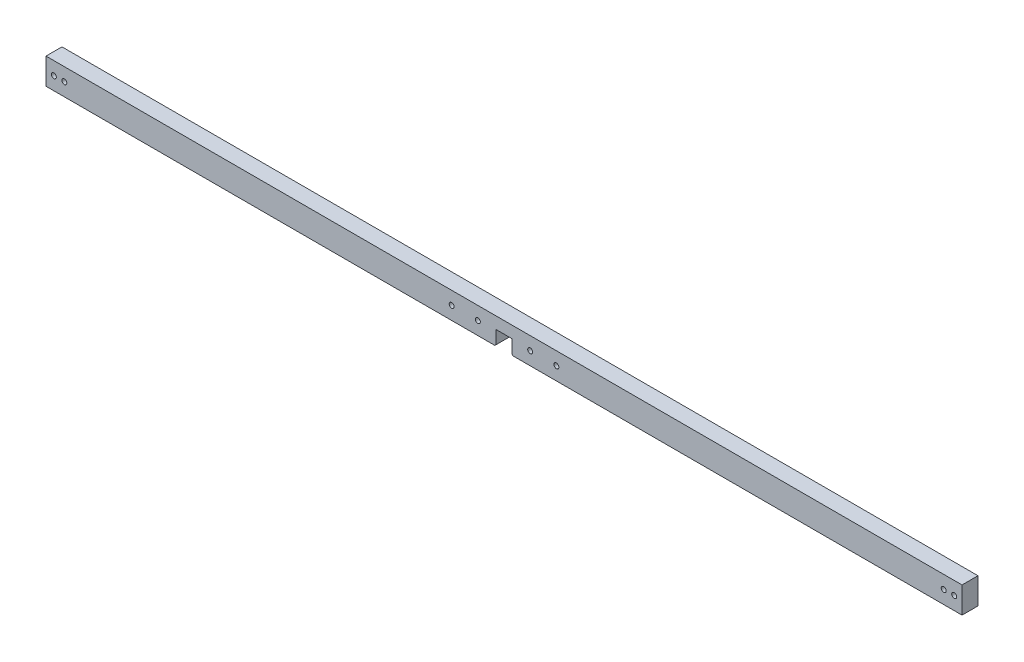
ISO-10303-21;
HEADER;
FILE_DESCRIPTION(('STEP AP214'),'2;1');
FILE_NAME('part.step','',(''),(''),'','','');
FILE_SCHEMA(('AUTOMOTIVE_DESIGN { 1 0 10303 214 1 1 1 1 }'));
ENDSEC;
DATA;
#1=APPLICATION_CONTEXT('core data for automotive mechanical design processes');
#2=APPLICATION_PROTOCOL_DEFINITION('international standard','automotive_design',2000,#1);
#3=PRODUCT_CONTEXT('',#1,'mechanical');
#4=PRODUCT('Part','Part','',(#3));
#5=PRODUCT_RELATED_PRODUCT_CATEGORY('part','',(#4));
#6=PRODUCT_DEFINITION_FORMATION('','',#4);
#7=PRODUCT_DEFINITION_CONTEXT('part definition',#1,'design');
#8=PRODUCT_DEFINITION('design','',#6,#7);
#9=PRODUCT_DEFINITION_SHAPE('','',#8);
#10=(LENGTH_UNIT() NAMED_UNIT(*) SI_UNIT(.MILLI.,.METRE.));
#11=(NAMED_UNIT(*) PLANE_ANGLE_UNIT() SI_UNIT($,.RADIAN.));
#12=(NAMED_UNIT(*) SI_UNIT($,.STERADIAN.) SOLID_ANGLE_UNIT());
#13=UNCERTAINTY_MEASURE_WITH_UNIT(LENGTH_MEASURE(1.E-05),#10,'distance_accuracy_value','');
#14=(GEOMETRIC_REPRESENTATION_CONTEXT(3) GLOBAL_UNCERTAINTY_ASSIGNED_CONTEXT((#13)) GLOBAL_UNIT_ASSIGNED_CONTEXT((#10,
#11,#12)) REPRESENTATION_CONTEXT('',''));
#15=CARTESIAN_POINT('',(0.,0.,0.));
#16=DIRECTION('',(0.,0.,1.));
#17=DIRECTION('',(1.,0.,0.));
#18=AXIS2_PLACEMENT_3D('',#15,#16,#17);
#19=CARTESIAN_POINT('',(175.,-4.99999999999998,3.05));
#20=DIRECTION('',(0.,1.,0.));
#21=DIRECTION('',(-1.,0.,0.));
#22=AXIS2_PLACEMENT_3D('',#19,#20,#21);
#23=PLANE('',#22);
#24=DIRECTION('',(1.,0.,0.));
#25=VECTOR('',#24,1.);
#26=CARTESIAN_POINT('',(175.,-4.99999999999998,3.05));
#27=LINE('',#26,#25);
#28=CARTESIAN_POINT('',(3.49999999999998,-5.,3.05));
#29=VERTEX_POINT('',#28);
#30=CARTESIAN_POINT('',(175.,-4.99999999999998,3.05));
#31=VERTEX_POINT('',#30);
#32=EDGE_CURVE('E188',#29,#31,#27,.T.);
#33=ORIENTED_EDGE('',*,*,#32,.F.);
#34=DIRECTION('',(0.,0.,-1.));
#35=VECTOR('',#34,1.);
#36=CARTESIAN_POINT('',(3.49999999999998,-5.,3.05));
#37=LINE('',#36,#35);
#38=CARTESIAN_POINT('',(3.49999999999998,-5.,-3.05));
#39=VERTEX_POINT('',#38);
#40=EDGE_CURVE('E223',#29,#39,#37,.T.);
#41=ORIENTED_EDGE('',*,*,#40,.T.);
#42=DIRECTION('',(1.,0.,0.));
#43=VECTOR('',#42,1.);
#44=CARTESIAN_POINT('',(175.,-4.99999999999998,-3.05));
#45=LINE('',#44,#43);
#46=CARTESIAN_POINT('',(175.,-4.99999999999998,-3.05));
#47=VERTEX_POINT('',#46);
#48=EDGE_CURVE('E199',#39,#47,#45,.T.);
#49=ORIENTED_EDGE('',*,*,#48,.T.);
#50=DIRECTION('',(0.,0.,-1.));
#51=VECTOR('',#50,1.);
#52=CARTESIAN_POINT('',(175.,-4.99999999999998,3.05));
#53=LINE('',#52,#51);
#54=EDGE_CURVE('E211',#31,#47,#53,.T.);
#55=ORIENTED_EDGE('',*,*,#54,.F.);
#56=EDGE_LOOP('',(#33,#41,#49,#55));
#57=FACE_BOUND('',#56,.T.);
#58=ADVANCED_FACE('F33',(#57),#23,.F.);
#59=CARTESIAN_POINT('',(-175.,-5.00000000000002,3.05));
#60=DIRECTION('',(1.,0.,0.));
#61=DIRECTION('',(0.,0.,-1.));
#62=AXIS2_PLACEMENT_3D('',#59,#60,#61);
#63=PLANE('',#62);
#64=DIRECTION('',(0.,-1.,0.));
#65=VECTOR('',#64,1.);
#66=CARTESIAN_POINT('',(-175.,-5.00000000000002,-3.05));
#67=LINE('',#66,#65);
#68=CARTESIAN_POINT('',(-175.,4.99999999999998,-3.05));
#69=VERTEX_POINT('',#68);
#70=CARTESIAN_POINT('',(-175.,-5.00000000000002,-3.05));
#71=VERTEX_POINT('',#70);
#72=EDGE_CURVE('E164',#69,#71,#67,.T.);
#73=ORIENTED_EDGE('',*,*,#72,.T.);
#74=DIRECTION('',(0.,0.,-1.));
#75=VECTOR('',#74,1.);
#76=CARTESIAN_POINT('',(-175.,-5.00000000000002,3.05));
#77=LINE('',#76,#75);
#78=CARTESIAN_POINT('',(-175.,-5.00000000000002,3.05));
#79=VERTEX_POINT('',#78);
#80=EDGE_CURVE('E214',#79,#71,#77,.T.);
#81=ORIENTED_EDGE('',*,*,#80,.F.);
#82=DIRECTION('',(0.,-1.,0.));
#83=VECTOR('',#82,1.);
#84=CARTESIAN_POINT('',(-175.,-5.00000000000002,3.05));
#85=LINE('',#84,#83);
#86=CARTESIAN_POINT('',(-175.,4.99999999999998,3.05));
#87=VERTEX_POINT('',#86);
#88=EDGE_CURVE('E185',#87,#79,#85,.T.);
#89=ORIENTED_EDGE('',*,*,#88,.F.);
#90=DIRECTION('',(0.,0.,-1.));
#91=VECTOR('',#90,1.);
#92=CARTESIAN_POINT('',(-175.,4.99999999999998,3.05));
#93=LINE('',#92,#91);
#94=EDGE_CURVE('E196',#87,#69,#93,.T.);
#95=ORIENTED_EDGE('',*,*,#94,.T.);
#96=EDGE_LOOP('',(#73,#81,#89,#95));
#97=FACE_BOUND('',#96,.T.);
#98=ADVANCED_FACE('F241',(#97),#63,.F.);
#99=CARTESIAN_POINT('',(-3.50000000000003,-5.,-3.05));
#100=VERTEX_POINT('',#99);
#101=EDGE_CURVE('E200',#71,#100,#45,.T.);
#102=ORIENTED_EDGE('',*,*,#101,.T.);
#103=DIRECTION('',(0.,0.,1.));
#104=VECTOR('',#103,1.);
#105=CARTESIAN_POINT('',(-3.50000000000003,-5.,3.05));
#106=LINE('',#105,#104);
#107=CARTESIAN_POINT('',(-3.50000000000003,-5.,3.05));
#108=VERTEX_POINT('',#107);
#109=EDGE_CURVE('E41',#100,#108,#106,.T.);
#110=ORIENTED_EDGE('',*,*,#109,.T.);
#111=EDGE_CURVE('E190',#79,#108,#27,.T.);
#112=ORIENTED_EDGE('',*,*,#111,.F.);
#113=ORIENTED_EDGE('',*,*,#80,.T.);
#114=EDGE_LOOP('',(#102,#110,#112,#113));
#115=FACE_BOUND('',#114,.T.);
#116=ADVANCED_FACE('F234',(#115),#23,.F.);
#117=CARTESIAN_POINT('',(175.,-4.99999999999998,3.05));
#118=DIRECTION('',(-1.,0.,0.));
#119=DIRECTION('',(0.,0.,1.));
#120=AXIS2_PLACEMENT_3D('',#117,#118,#119);
#121=PLANE('',#120);
#122=DIRECTION('',(0.,1.,0.));
#123=VECTOR('',#122,1.);
#124=CARTESIAN_POINT('',(175.,-4.99999999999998,-3.05));
#125=LINE('',#124,#123);
#126=CARTESIAN_POINT('',(175.,5.00000000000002,-3.05));
#127=VERTEX_POINT('',#126);
#128=EDGE_CURVE('E203',#47,#127,#125,.T.);
#129=ORIENTED_EDGE('',*,*,#128,.T.);
#130=DIRECTION('',(0.,0.,-1.));
#131=VECTOR('',#130,1.);
#132=CARTESIAN_POINT('',(175.,5.00000000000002,3.05));
#133=LINE('',#132,#131);
#134=CARTESIAN_POINT('',(175.,5.00000000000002,3.05));
#135=VERTEX_POINT('',#134);
#136=EDGE_CURVE('E208',#135,#127,#133,.T.);
#137=ORIENTED_EDGE('',*,*,#136,.F.);
#138=DIRECTION('',(0.,1.,0.));
#139=VECTOR('',#138,1.);
#140=CARTESIAN_POINT('',(175.,-4.99999999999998,3.05));
#141=LINE('',#140,#139);
#142=EDGE_CURVE('E192',#31,#135,#141,.T.);
#143=ORIENTED_EDGE('',*,*,#142,.F.);
#144=ORIENTED_EDGE('',*,*,#54,.T.);
#145=EDGE_LOOP('',(#129,#137,#143,#144));
#146=FACE_BOUND('',#145,.T.);
#147=ADVANCED_FACE('F261',(#146),#121,.F.);
#148=CARTESIAN_POINT('',(175.,5.00000000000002,3.05));
#149=DIRECTION('',(0.,-1.,0.));
#150=DIRECTION('',(1.,0.,0.));
#151=AXIS2_PLACEMENT_3D('',#148,#149,#150);
#152=PLANE('',#151);
#153=DIRECTION('',(-1.,0.,0.));
#154=VECTOR('',#153,1.);
#155=CARTESIAN_POINT('',(175.,5.00000000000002,-3.05));
#156=LINE('',#155,#154);
#157=EDGE_CURVE('E189',#127,#69,#156,.T.);
#158=ORIENTED_EDGE('',*,*,#157,.T.);
#159=ORIENTED_EDGE('',*,*,#94,.F.);
#160=DIRECTION('',(-1.,0.,0.));
#161=VECTOR('',#160,1.);
#162=CARTESIAN_POINT('',(175.,5.00000000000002,3.05));
#163=LINE('',#162,#161);
#164=EDGE_CURVE('E194',#135,#87,#163,.T.);
#165=ORIENTED_EDGE('',*,*,#164,.F.);
#166=ORIENTED_EDGE('',*,*,#136,.T.);
#167=EDGE_LOOP('',(#158,#159,#165,#166));
#168=FACE_BOUND('',#167,.T.);
#169=ADVANCED_FACE('F263',(#168),#152,.F.);
#170=CARTESIAN_POINT('',(0.,0.,3.05));
#171=DIRECTION('',(0.,0.,1.));
#172=DIRECTION('',(1.,0.,0.));
#173=AXIS2_PLACEMENT_3D('',#170,#171,#172);
#174=PLANE('',#173);
#175=DIRECTION('',(0.,1.,0.));
#176=VECTOR('',#175,1.);
#177=CARTESIAN_POINT('',(3.,-12.5622462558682,3.05));
#178=LINE('',#177,#176);
#179=CARTESIAN_POINT('',(3.,-4.50000000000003,3.05));
#180=VERTEX_POINT('',#179);
#181=CARTESIAN_POINT('',(3.,0.5,3.05));
#182=VERTEX_POINT('',#181);
#183=EDGE_CURVE('E110',#180,#182,#178,.T.);
#184=ORIENTED_EDGE('',*,*,#183,.F.);
#185=DIRECTION('',(-0.707106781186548,0.707106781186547,0.));
#186=VECTOR('',#185,1.);
#187=CARTESIAN_POINT('',(-0.750000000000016,-0.750000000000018,3.05));
#188=LINE('',#187,#186);
#189=EDGE_CURVE('E232',#180,#29,#188,.F.);
#190=ORIENTED_EDGE('',*,*,#189,.T.);
#191=ORIENTED_EDGE('',*,*,#32,.T.);
#192=ORIENTED_EDGE('',*,*,#142,.T.);
#193=ORIENTED_EDGE('',*,*,#164,.T.);
#194=ORIENTED_EDGE('',*,*,#88,.T.);
#195=ORIENTED_EDGE('',*,*,#111,.T.);
#196=DIRECTION('',(-0.70710678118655,-0.707106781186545,0.));
#197=VECTOR('',#196,1.);
#198=CARTESIAN_POINT('',(0.749999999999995,-0.75,3.05));
#199=LINE('',#198,#197);
#200=CARTESIAN_POINT('',(-3.,-4.49999999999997,3.05));
#201=VERTEX_POINT('',#200);
#202=EDGE_CURVE('E48',#108,#201,#199,.F.);
#203=ORIENTED_EDGE('',*,*,#202,.T.);
#204=DIRECTION('',(0.,-1.,0.));
#205=VECTOR('',#204,1.);
#206=CARTESIAN_POINT('',(-3.,-12.5622462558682,3.05));
#207=LINE('',#206,#205);
#208=CARTESIAN_POINT('',(-3.,0.5,3.05));
#209=VERTEX_POINT('',#208);
#210=EDGE_CURVE('E128',#209,#201,#207,.T.);
#211=ORIENTED_EDGE('',*,*,#210,.F.);
#212=DIRECTION('',(-1.,0.,0.));
#213=VECTOR('',#212,1.);
#214=CARTESIAN_POINT('',(-3.,0.5,3.05));
#215=LINE('',#214,#213);
#216=EDGE_CURVE('E119',#182,#209,#215,.T.);
#217=ORIENTED_EDGE('',*,*,#216,.F.);
#218=EDGE_LOOP('',(#184,#190,#191,#192,#193,#194,#195,#203,#211,#217));
#219=FACE_BOUND('',#218,.T.);
#220=CARTESIAN_POINT('',(-10.,0.,3.05));
#221=DIRECTION('',(0.,0.,-1.));
#222=DIRECTION('',(-1.,0.,0.));
#223=AXIS2_PLACEMENT_3D('',#220,#221,#222);
#224=CIRCLE('',#223,0.949999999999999);
#225=CARTESIAN_POINT('',(-10.95,0.,3.05));
#226=VERTEX_POINT('',#225);
#227=EDGE_CURVE('E141',#226,#226,#224,.T.);
#228=ORIENTED_EDGE('',*,*,#227,.T.);
#229=EDGE_LOOP('',(#228));
#230=FACE_BOUND('',#229,.T.);
#231=CARTESIAN_POINT('',(-168.,0.,3.05));
#232=DIRECTION('',(0.,0.,-1.));
#233=DIRECTION('',(-1.,0.,0.));
#234=AXIS2_PLACEMENT_3D('',#231,#232,#233);
#235=CIRCLE('',#234,0.950000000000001);
#236=CARTESIAN_POINT('',(-168.95,0.,3.05));
#237=VERTEX_POINT('',#236);
#238=EDGE_CURVE('E135',#237,#237,#235,.T.);
#239=ORIENTED_EDGE('',*,*,#238,.T.);
#240=EDGE_LOOP('',(#239));
#241=FACE_BOUND('',#240,.T.);
#242=CARTESIAN_POINT('',(-172.,0.,3.05));
#243=DIRECTION('',(0.,0.,-1.));
#244=DIRECTION('',(-1.,0.,0.));
#245=AXIS2_PLACEMENT_3D('',#242,#243,#244);
#246=CIRCLE('',#245,0.950000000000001);
#247=CARTESIAN_POINT('',(-172.95,0.,3.05));
#248=VERTEX_POINT('',#247);
#249=EDGE_CURVE('E148',#248,#248,#246,.T.);
#250=ORIENTED_EDGE('',*,*,#249,.T.);
#251=EDGE_LOOP('',(#250));
#252=FACE_BOUND('',#251,.T.);
#253=CARTESIAN_POINT('',(-20.,0.,3.05));
#254=DIRECTION('',(0.,0.,-1.));
#255=DIRECTION('',(-1.,0.,0.));
#256=AXIS2_PLACEMENT_3D('',#253,#254,#255);
#257=CIRCLE('',#256,0.950000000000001);
#258=CARTESIAN_POINT('',(-20.95,0.,3.05));
#259=VERTEX_POINT('',#258);
#260=EDGE_CURVE('E153',#259,#259,#257,.T.);
#261=ORIENTED_EDGE('',*,*,#260,.T.);
#262=EDGE_LOOP('',(#261));
#263=FACE_BOUND('',#262,.T.);
#264=CARTESIAN_POINT('',(10.,0.,3.05));
#265=DIRECTION('',(0.,0.,1.));
#266=DIRECTION('',(1.,0.,0.));
#267=AXIS2_PLACEMENT_3D('',#264,#265,#266);
#268=CIRCLE('',#267,0.949999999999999);
#269=CARTESIAN_POINT('',(10.95,0.,3.05));
#270=VERTEX_POINT('',#269);
#271=EDGE_CURVE('E165',#270,#270,#268,.T.);
#272=ORIENTED_EDGE('',*,*,#271,.F.);
#273=EDGE_LOOP('',(#272));
#274=FACE_BOUND('',#273,.T.);
#275=CARTESIAN_POINT('',(168.,0.,3.05));
#276=DIRECTION('',(0.,0.,1.));
#277=DIRECTION('',(1.,0.,0.));
#278=AXIS2_PLACEMENT_3D('',#275,#276,#277);
#279=CIRCLE('',#278,0.950000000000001);
#280=CARTESIAN_POINT('',(168.95,0.,3.05));
#281=VERTEX_POINT('',#280);
#282=EDGE_CURVE('E140',#281,#281,#279,.T.);
#283=ORIENTED_EDGE('',*,*,#282,.F.);
#284=EDGE_LOOP('',(#283));
#285=FACE_BOUND('',#284,.T.);
#286=CARTESIAN_POINT('',(172.,0.,3.05));
#287=DIRECTION('',(0.,0.,1.));
#288=DIRECTION('',(1.,0.,0.));
#289=AXIS2_PLACEMENT_3D('',#286,#287,#288);
#290=CIRCLE('',#289,0.950000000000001);
#291=CARTESIAN_POINT('',(172.95,0.,3.05));
#292=VERTEX_POINT('',#291);
#293=EDGE_CURVE('E172',#292,#292,#290,.T.);
#294=ORIENTED_EDGE('',*,*,#293,.F.);
#295=EDGE_LOOP('',(#294));
#296=FACE_BOUND('',#295,.T.);
#297=CARTESIAN_POINT('',(20.,0.,3.05));
#298=DIRECTION('',(0.,0.,1.));
#299=DIRECTION('',(1.,0.,0.));
#300=AXIS2_PLACEMENT_3D('',#297,#298,#299);
#301=CIRCLE('',#300,0.950000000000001);
#302=CARTESIAN_POINT('',(20.95,0.,3.05));
#303=VERTEX_POINT('',#302);
#304=EDGE_CURVE('E177',#303,#303,#301,.T.);
#305=ORIENTED_EDGE('',*,*,#304,.F.);
#306=EDGE_LOOP('',(#305));
#307=FACE_BOUND('',#306,.T.);
#308=ADVANCED_FACE('F130',(#219,#230,#241,#252,#263,#274,#285,#296,#307),#174,.T.);
#309=CARTESIAN_POINT('',(0.,0.,-3.05));
#310=DIRECTION('',(0.,0.,1.));
#311=DIRECTION('',(1.,0.,0.));
#312=AXIS2_PLACEMENT_3D('',#309,#310,#311);
#313=PLANE('',#312);
#314=ORIENTED_EDGE('',*,*,#48,.F.);
#315=DIRECTION('',(0.707106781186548,-0.707106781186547,0.));
#316=VECTOR('',#315,1.);
#317=CARTESIAN_POINT('',(3.49999999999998,-5.,-3.05));
#318=LINE('',#317,#316);
#319=CARTESIAN_POINT('',(3.,-4.50000000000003,-3.05));
#320=VERTEX_POINT('',#319);
#321=EDGE_CURVE('E228',#39,#320,#318,.F.);
#322=ORIENTED_EDGE('',*,*,#321,.T.);
#323=DIRECTION('',(0.,1.,0.));
#324=VECTOR('',#323,1.);
#325=CARTESIAN_POINT('',(3.,0.,-3.05));
#326=LINE('',#325,#324);
#327=CARTESIAN_POINT('',(3.,0.5,-3.05));
#328=VERTEX_POINT('',#327);
#329=EDGE_CURVE('E221',#320,#328,#326,.T.);
#330=ORIENTED_EDGE('',*,*,#329,.T.);
#331=DIRECTION('',(-1.,0.,0.));
#332=VECTOR('',#331,1.);
#333=CARTESIAN_POINT('',(0.,0.5,-3.05));
#334=LINE('',#333,#332);
#335=CARTESIAN_POINT('',(-3.,0.5,-3.05));
#336=VERTEX_POINT('',#335);
#337=EDGE_CURVE('E126',#328,#336,#334,.T.);
#338=ORIENTED_EDGE('',*,*,#337,.T.);
#339=DIRECTION('',(0.,-1.,0.));
#340=VECTOR('',#339,1.);
#341=CARTESIAN_POINT('',(-3.,0.,-3.05));
#342=LINE('',#341,#340);
#343=CARTESIAN_POINT('',(-3.,-4.49999999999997,-3.05));
#344=VERTEX_POINT('',#343);
#345=EDGE_CURVE('E218',#336,#344,#342,.T.);
#346=ORIENTED_EDGE('',*,*,#345,.T.);
#347=DIRECTION('',(0.70710678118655,0.707106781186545,0.));
#348=VECTOR('',#347,1.);
#349=CARTESIAN_POINT('',(-3.50000000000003,-5.,-3.05));
#350=LINE('',#349,#348);
#351=EDGE_CURVE('E226',#344,#100,#350,.F.);
#352=ORIENTED_EDGE('',*,*,#351,.T.);
#353=ORIENTED_EDGE('',*,*,#101,.F.);
#354=ORIENTED_EDGE('',*,*,#72,.F.);
#355=ORIENTED_EDGE('',*,*,#157,.F.);
#356=ORIENTED_EDGE('',*,*,#128,.F.);
#357=EDGE_LOOP('',(#314,#322,#330,#338,#346,#352,#353,#354,#355,#356));
#358=FACE_BOUND('',#357,.T.);
#359=CARTESIAN_POINT('',(-10.,0.,-3.05));
#360=DIRECTION('',(0.,0.,-1.));
#361=DIRECTION('',(-1.,0.,0.));
#362=AXIS2_PLACEMENT_3D('',#359,#360,#361);
#363=CIRCLE('',#362,0.949999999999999);
#364=CARTESIAN_POINT('',(-10.95,0.,-3.05));
#365=VERTEX_POINT('',#364);
#366=EDGE_CURVE('E137',#365,#365,#363,.T.);
#367=ORIENTED_EDGE('',*,*,#366,.F.);
#368=EDGE_LOOP('',(#367));
#369=FACE_BOUND('',#368,.T.);
#370=CARTESIAN_POINT('',(-168.,0.,-3.05));
#371=DIRECTION('',(0.,0.,-1.));
#372=DIRECTION('',(-1.,0.,0.));
#373=AXIS2_PLACEMENT_3D('',#370,#371,#372);
#374=CIRCLE('',#373,0.950000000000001);
#375=CARTESIAN_POINT('',(-168.95,0.,-3.05));
#376=VERTEX_POINT('',#375);
#377=EDGE_CURVE('E145',#376,#376,#374,.T.);
#378=ORIENTED_EDGE('',*,*,#377,.F.);
#379=EDGE_LOOP('',(#378));
#380=FACE_BOUND('',#379,.T.);
#381=CARTESIAN_POINT('',(-172.,0.,-3.05));
#382=DIRECTION('',(0.,0.,-1.));
#383=DIRECTION('',(-1.,0.,0.));
#384=AXIS2_PLACEMENT_3D('',#381,#382,#383);
#385=CIRCLE('',#384,0.950000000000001);
#386=CARTESIAN_POINT('',(-172.95,0.,-3.05));
#387=VERTEX_POINT('',#386);
#388=EDGE_CURVE('E156',#387,#387,#385,.T.);
#389=ORIENTED_EDGE('',*,*,#388,.F.);
#390=EDGE_LOOP('',(#389));
#391=FACE_BOUND('',#390,.T.);
#392=CARTESIAN_POINT('',(-20.,0.,-3.05));
#393=DIRECTION('',(0.,0.,-1.));
#394=DIRECTION('',(-1.,0.,0.));
#395=AXIS2_PLACEMENT_3D('',#392,#393,#394);
#396=CIRCLE('',#395,0.950000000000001);
#397=CARTESIAN_POINT('',(-20.95,0.,-3.05));
#398=VERTEX_POINT('',#397);
#399=EDGE_CURVE('E144',#398,#398,#396,.T.);
#400=ORIENTED_EDGE('',*,*,#399,.F.);
#401=EDGE_LOOP('',(#400));
#402=FACE_BOUND('',#401,.T.);
#403=CARTESIAN_POINT('',(10.,0.,-3.05));
#404=DIRECTION('',(0.,0.,1.));
#405=DIRECTION('',(1.,0.,0.));
#406=AXIS2_PLACEMENT_3D('',#403,#404,#405);
#407=CIRCLE('',#406,0.949999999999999);
#408=CARTESIAN_POINT('',(10.95,0.,-3.05));
#409=VERTEX_POINT('',#408);
#410=EDGE_CURVE('E161',#409,#409,#407,.T.);
#411=ORIENTED_EDGE('',*,*,#410,.T.);
#412=EDGE_LOOP('',(#411));
#413=FACE_BOUND('',#412,.T.);
#414=CARTESIAN_POINT('',(168.,0.,-3.05));
#415=DIRECTION('',(0.,0.,1.));
#416=DIRECTION('',(1.,0.,0.));
#417=AXIS2_PLACEMENT_3D('',#414,#415,#416);
#418=CIRCLE('',#417,0.950000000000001);
#419=CARTESIAN_POINT('',(168.95,0.,-3.05));
#420=VERTEX_POINT('',#419);
#421=EDGE_CURVE('E169',#420,#420,#418,.T.);
#422=ORIENTED_EDGE('',*,*,#421,.T.);
#423=EDGE_LOOP('',(#422));
#424=FACE_BOUND('',#423,.T.);
#425=CARTESIAN_POINT('',(172.,0.,-3.05));
#426=DIRECTION('',(0.,0.,1.));
#427=DIRECTION('',(1.,0.,0.));
#428=AXIS2_PLACEMENT_3D('',#425,#426,#427);
#429=CIRCLE('',#428,0.950000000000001);
#430=CARTESIAN_POINT('',(172.95,0.,-3.05));
#431=VERTEX_POINT('',#430);
#432=EDGE_CURVE('E180',#431,#431,#429,.T.);
#433=ORIENTED_EDGE('',*,*,#432,.T.);
#434=EDGE_LOOP('',(#433));
#435=FACE_BOUND('',#434,.T.);
#436=CARTESIAN_POINT('',(20.,0.,-3.05));
#437=DIRECTION('',(0.,0.,1.));
#438=DIRECTION('',(1.,0.,0.));
#439=AXIS2_PLACEMENT_3D('',#436,#437,#438);
#440=CIRCLE('',#439,0.950000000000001);
#441=CARTESIAN_POINT('',(20.95,0.,-3.05));
#442=VERTEX_POINT('',#441);
#443=EDGE_CURVE('E168',#442,#442,#440,.T.);
#444=ORIENTED_EDGE('',*,*,#443,.T.);
#445=EDGE_LOOP('',(#444));
#446=FACE_BOUND('',#445,.T.);
#447=ADVANCED_FACE('F246',(#358,#369,#380,#391,#402,#413,#424,#435,#446),#313,.F.);
#448=CARTESIAN_POINT('',(20.,0.,-3.05));
#449=DIRECTION('',(0.,0.,1.));
#450=DIRECTION('',(1.,0.,0.));
#451=AXIS2_PLACEMENT_3D('',#448,#449,#450);
#452=CYLINDRICAL_SURFACE('',#451,0.950000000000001);
#453=ORIENTED_EDGE('',*,*,#443,.F.);
#454=EDGE_LOOP('',(#453));
#455=FACE_BOUND('',#454,.T.);
#456=ORIENTED_EDGE('',*,*,#304,.T.);
#457=EDGE_LOOP('',(#456));
#458=FACE_BOUND('',#457,.T.);
#459=ADVANCED_FACE('F301',(#455,#458),#452,.F.);
#460=CARTESIAN_POINT('',(172.,0.,-3.05));
#461=DIRECTION('',(0.,0.,1.));
#462=DIRECTION('',(1.,0.,0.));
#463=AXIS2_PLACEMENT_3D('',#460,#461,#462);
#464=CYLINDRICAL_SURFACE('',#463,0.950000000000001);
#465=ORIENTED_EDGE('',*,*,#432,.F.);
#466=EDGE_LOOP('',(#465));
#467=FACE_BOUND('',#466,.T.);
#468=ORIENTED_EDGE('',*,*,#293,.T.);
#469=EDGE_LOOP('',(#468));
#470=FACE_BOUND('',#469,.T.);
#471=ADVANCED_FACE('F306',(#467,#470),#464,.F.);
#472=CARTESIAN_POINT('',(168.,0.,-3.05));
#473=DIRECTION('',(0.,0.,1.));
#474=DIRECTION('',(1.,0.,0.));
#475=AXIS2_PLACEMENT_3D('',#472,#473,#474);
#476=CYLINDRICAL_SURFACE('',#475,0.950000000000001);
#477=ORIENTED_EDGE('',*,*,#421,.F.);
#478=EDGE_LOOP('',(#477));
#479=FACE_BOUND('',#478,.T.);
#480=ORIENTED_EDGE('',*,*,#282,.T.);
#481=EDGE_LOOP('',(#480));
#482=FACE_BOUND('',#481,.T.);
#483=ADVANCED_FACE('F318',(#479,#482),#476,.F.);
#484=CARTESIAN_POINT('',(10.,0.,-3.05));
#485=DIRECTION('',(0.,0.,1.));
#486=DIRECTION('',(1.,0.,0.));
#487=AXIS2_PLACEMENT_3D('',#484,#485,#486);
#488=CYLINDRICAL_SURFACE('',#487,0.949999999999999);
#489=ORIENTED_EDGE('',*,*,#410,.F.);
#490=EDGE_LOOP('',(#489));
#491=FACE_BOUND('',#490,.T.);
#492=ORIENTED_EDGE('',*,*,#271,.T.);
#493=EDGE_LOOP('',(#492));
#494=FACE_BOUND('',#493,.T.);
#495=ADVANCED_FACE('F328',(#491,#494),#488,.F.);
#496=CARTESIAN_POINT('',(-20.,0.,-3.05));
#497=DIRECTION('',(0.,0.,1.));
#498=DIRECTION('',(1.,0.,0.));
#499=AXIS2_PLACEMENT_3D('',#496,#497,#498);
#500=CYLINDRICAL_SURFACE('',#499,0.950000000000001);
#501=ORIENTED_EDGE('',*,*,#399,.T.);
#502=EDGE_LOOP('',(#501));
#503=FACE_BOUND('',#502,.T.);
#504=ORIENTED_EDGE('',*,*,#260,.F.);
#505=EDGE_LOOP('',(#504));
#506=FACE_BOUND('',#505,.T.);
#507=ADVANCED_FACE('F338',(#503,#506),#500,.F.);
#508=CARTESIAN_POINT('',(-172.,0.,-3.05));
#509=DIRECTION('',(0.,0.,1.));
#510=DIRECTION('',(1.,0.,0.));
#511=AXIS2_PLACEMENT_3D('',#508,#509,#510);
#512=CYLINDRICAL_SURFACE('',#511,0.950000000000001);
#513=ORIENTED_EDGE('',*,*,#388,.T.);
#514=EDGE_LOOP('',(#513));
#515=FACE_BOUND('',#514,.T.);
#516=ORIENTED_EDGE('',*,*,#249,.F.);
#517=EDGE_LOOP('',(#516));
#518=FACE_BOUND('',#517,.T.);
#519=ADVANCED_FACE('F348',(#515,#518),#512,.F.);
#520=CARTESIAN_POINT('',(-168.,0.,-3.05));
#521=DIRECTION('',(0.,0.,1.));
#522=DIRECTION('',(1.,0.,0.));
#523=AXIS2_PLACEMENT_3D('',#520,#521,#522);
#524=CYLINDRICAL_SURFACE('',#523,0.950000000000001);
#525=ORIENTED_EDGE('',*,*,#377,.T.);
#526=EDGE_LOOP('',(#525));
#527=FACE_BOUND('',#526,.T.);
#528=ORIENTED_EDGE('',*,*,#238,.F.);
#529=EDGE_LOOP('',(#528));
#530=FACE_BOUND('',#529,.T.);
#531=ADVANCED_FACE('F358',(#527,#530),#524,.F.);
#532=CARTESIAN_POINT('',(-10.,0.,-3.05));
#533=DIRECTION('',(0.,0.,1.));
#534=DIRECTION('',(1.,0.,0.));
#535=AXIS2_PLACEMENT_3D('',#532,#533,#534);
#536=CYLINDRICAL_SURFACE('',#535,0.949999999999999);
#537=ORIENTED_EDGE('',*,*,#366,.T.);
#538=EDGE_LOOP('',(#537));
#539=FACE_BOUND('',#538,.T.);
#540=ORIENTED_EDGE('',*,*,#227,.F.);
#541=EDGE_LOOP('',(#540));
#542=FACE_BOUND('',#541,.T.);
#543=ADVANCED_FACE('F368',(#539,#542),#536,.F.);
#544=CARTESIAN_POINT('',(3.,-12.5622462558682,-6.95));
#545=DIRECTION('',(1.,0.,0.));
#546=DIRECTION('',(0.,0.,-1.));
#547=AXIS2_PLACEMENT_3D('',#544,#545,#546);
#548=PLANE('',#547);
#549=ORIENTED_EDGE('',*,*,#329,.F.);
#550=DIRECTION('',(0.,0.,1.));
#551=VECTOR('',#550,1.);
#552=CARTESIAN_POINT('',(3.,-4.50000000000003,-6.95));
#553=LINE('',#552,#551);
#554=EDGE_CURVE('E116',#320,#180,#553,.T.);
#555=ORIENTED_EDGE('',*,*,#554,.T.);
#556=ORIENTED_EDGE('',*,*,#183,.T.);
#557=DIRECTION('',(0.,0.,1.));
#558=VECTOR('',#557,1.);
#559=CARTESIAN_POINT('',(3.,0.5,-6.95));
#560=LINE('',#559,#558);
#561=EDGE_CURVE('E114',#328,#182,#560,.T.);
#562=ORIENTED_EDGE('',*,*,#561,.F.);
#563=EDGE_LOOP('',(#549,#555,#556,#562));
#564=FACE_BOUND('',#563,.T.);
#565=ADVANCED_FACE('F113',(#564),#548,.F.);
#566=CARTESIAN_POINT('',(-3.,-12.5622462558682,-6.95));
#567=DIRECTION('',(-1.,0.,0.));
#568=DIRECTION('',(0.,0.,1.));
#569=AXIS2_PLACEMENT_3D('',#566,#567,#568);
#570=PLANE('',#569);
#571=ORIENTED_EDGE('',*,*,#210,.T.);
#572=DIRECTION('',(0.,0.,-1.));
#573=VECTOR('',#572,1.);
#574=CARTESIAN_POINT('',(-3.,-4.49999999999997,-6.95));
#575=LINE('',#574,#573);
#576=EDGE_CURVE('E11',#201,#344,#575,.T.);
#577=ORIENTED_EDGE('',*,*,#576,.T.);
#578=ORIENTED_EDGE('',*,*,#345,.F.);
#579=DIRECTION('',(0.,0.,1.));
#580=VECTOR('',#579,1.);
#581=CARTESIAN_POINT('',(-3.,0.5,-6.95));
#582=LINE('',#581,#580);
#583=EDGE_CURVE('E127',#336,#209,#582,.T.);
#584=ORIENTED_EDGE('',*,*,#583,.T.);
#585=EDGE_LOOP('',(#571,#577,#578,#584));
#586=FACE_BOUND('',#585,.T.);
#587=ADVANCED_FACE('F251',(#586),#570,.F.);
#588=CARTESIAN_POINT('',(-3.,0.5,-6.95));
#589=DIRECTION('',(0.,1.,0.));
#590=DIRECTION('',(0.,0.,1.));
#591=AXIS2_PLACEMENT_3D('',#588,#589,#590);
#592=PLANE('',#591);
#593=ORIENTED_EDGE('',*,*,#561,.T.);
#594=ORIENTED_EDGE('',*,*,#216,.T.);
#595=ORIENTED_EDGE('',*,*,#583,.F.);
#596=ORIENTED_EDGE('',*,*,#337,.F.);
#597=EDGE_LOOP('',(#593,#594,#595,#596));
#598=FACE_BOUND('',#597,.T.);
#599=ADVANCED_FACE('F124',(#598),#592,.F.);
#600=CARTESIAN_POINT('',(3.49999999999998,-5.,3.05));
#601=DIRECTION('',(0.707106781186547,0.707106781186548,0.));
#602=DIRECTION('',(0.,0.,-1.));
#603=AXIS2_PLACEMENT_3D('',#600,#601,#602);
#604=PLANE('',#603);
#605=ORIENTED_EDGE('',*,*,#189,.F.);
#606=ORIENTED_EDGE('',*,*,#554,.F.);
#607=ORIENTED_EDGE('',*,*,#321,.F.);
#608=ORIENTED_EDGE('',*,*,#40,.F.);
#609=EDGE_LOOP('',(#605,#606,#607,#608));
#610=FACE_BOUND('',#609,.T.);
#611=ADVANCED_FACE('F253',(#610),#604,.F.);
#612=CARTESIAN_POINT('',(-3.50000000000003,-5.,3.05));
#613=DIRECTION('',(-0.707106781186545,0.70710678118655,0.));
#614=DIRECTION('',(0.,0.,1.));
#615=AXIS2_PLACEMENT_3D('',#612,#613,#614);
#616=PLANE('',#615);
#617=ORIENTED_EDGE('',*,*,#351,.F.);
#618=ORIENTED_EDGE('',*,*,#576,.F.);
#619=ORIENTED_EDGE('',*,*,#202,.F.);
#620=ORIENTED_EDGE('',*,*,#109,.F.);
#621=EDGE_LOOP('',(#617,#618,#619,#620));
#622=FACE_BOUND('',#621,.T.);
#623=ADVANCED_FACE('F35',(#622),#616,.F.);
#624=CLOSED_SHELL('',(#58,#98,#116,#147,#169,#308,#447,#459,#471,#483,#495,#507,#519,#531,#543,
#565,#587,#599,#611,#623));
#625=MANIFOLD_SOLID_BREP('B2',#624);
#626=ADVANCED_BREP_SHAPE_REPRESENTATION('',(#18,#625),#14);
#627=SHAPE_DEFINITION_REPRESENTATION(#9,#626);
ENDSEC;
END-ISO-10303-21;
